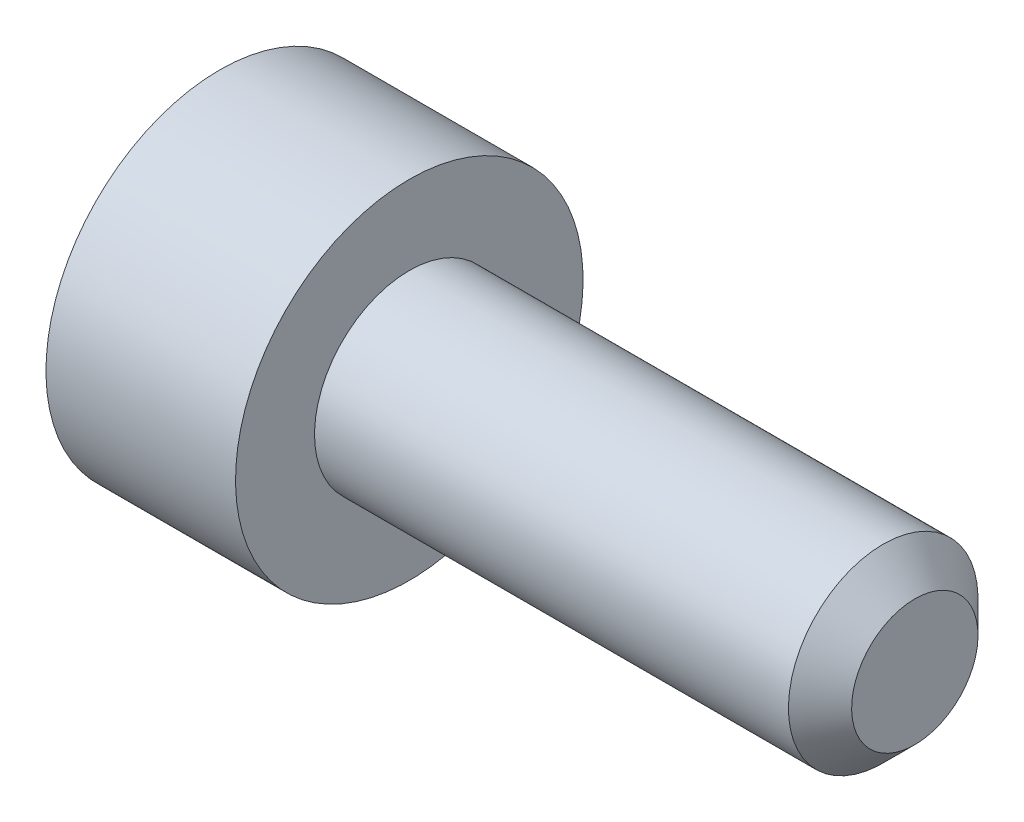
ISO-10303-21;
HEADER;
FILE_DESCRIPTION(('STEP AP214'),'2;1');
FILE_NAME('part.step','',(''),(''),'','','');
FILE_SCHEMA(('AUTOMOTIVE_DESIGN { 1 0 10303 214 1 1 1 1 }'));
ENDSEC;
DATA;
#1=APPLICATION_CONTEXT('core data for automotive mechanical design processes');
#2=APPLICATION_PROTOCOL_DEFINITION('international standard','automotive_design',2000,#1);
#3=PRODUCT_CONTEXT('',#1,'mechanical');
#4=PRODUCT('Part','Part','',(#3));
#5=PRODUCT_RELATED_PRODUCT_CATEGORY('part','',(#4));
#6=PRODUCT_DEFINITION_FORMATION('','',#4);
#7=PRODUCT_DEFINITION_CONTEXT('part definition',#1,'design');
#8=PRODUCT_DEFINITION('design','',#6,#7);
#9=PRODUCT_DEFINITION_SHAPE('','',#8);
#10=(LENGTH_UNIT() NAMED_UNIT(*) SI_UNIT(.MILLI.,.METRE.));
#11=(NAMED_UNIT(*) PLANE_ANGLE_UNIT() SI_UNIT($,.RADIAN.));
#12=(NAMED_UNIT(*) SI_UNIT($,.STERADIAN.) SOLID_ANGLE_UNIT());
#13=UNCERTAINTY_MEASURE_WITH_UNIT(LENGTH_MEASURE(1.E-05),#10,'distance_accuracy_value','');
#14=(GEOMETRIC_REPRESENTATION_CONTEXT(3) GLOBAL_UNCERTAINTY_ASSIGNED_CONTEXT((#13)) GLOBAL_UNIT_ASSIGNED_CONTEXT((#10,
#11,#12)) REPRESENTATION_CONTEXT('',''));
#15=CARTESIAN_POINT('',(0.,0.,0.));
#16=DIRECTION('',(0.,0.,1.));
#17=DIRECTION('',(1.,0.,0.));
#18=AXIS2_PLACEMENT_3D('',#15,#16,#17);
#19=CARTESIAN_POINT('',(-5.,6.875,0.));
#20=DIRECTION('',(-1.,0.,0.));
#21=DIRECTION('',(0.,0.,1.));
#22=AXIS2_PLACEMENT_3D('',#19,#20,#21);
#23=PLANE('',#22);
#24=DIRECTION('',(0.,-0.866025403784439,-0.5));
#25=VECTOR('',#24,1.);
#26=CARTESIAN_POINT('',(-5.,5.078125,1.19980602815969));
#27=LINE('',#26,#25);
#28=CARTESIAN_POINT('',(-5.,5.5,1.44337567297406));
#29=VERTEX_POINT('',#28);
#30=CARTESIAN_POINT('',(-5.,4.25,0.721687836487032));
#31=VERTEX_POINT('',#30);
#32=EDGE_CURVE('E10',#29,#31,#27,.T.);
#33=ORIENTED_EDGE('',*,*,#32,.T.);
#34=DIRECTION('',(0.,0.,-1.));
#35=VECTOR('',#34,1.);
#36=CARTESIAN_POINT('',(-5.,4.25,-0.360843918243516));
#37=LINE('',#36,#35);
#38=CARTESIAN_POINT('',(-5.,4.25,-0.721687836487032));
#39=VERTEX_POINT('',#38);
#40=EDGE_CURVE('E25',#31,#39,#37,.T.);
#41=ORIENTED_EDGE('',*,*,#40,.T.);
#42=DIRECTION('',(0.,0.866025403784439,-0.5));
#43=VECTOR('',#42,1.);
#44=CARTESIAN_POINT('',(-5.,5.703125,-1.56064994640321));
#45=LINE('',#44,#43);
#46=CARTESIAN_POINT('',(-5.,5.5,-1.44337567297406));
#47=VERTEX_POINT('',#46);
#48=EDGE_CURVE('E124',#39,#47,#45,.T.);
#49=ORIENTED_EDGE('',*,*,#48,.T.);
#50=DIRECTION('',(0.,0.866025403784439,0.5));
#51=VECTOR('',#50,1.);
#52=CARTESIAN_POINT('',(-5.,6.953125,-0.60441356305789));
#53=LINE('',#52,#51);
#54=CARTESIAN_POINT('',(-5.,6.75,-0.721687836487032));
#55=VERTEX_POINT('',#54);
#56=EDGE_CURVE('E115',#47,#55,#53,.T.);
#57=ORIENTED_EDGE('',*,*,#56,.T.);
#58=DIRECTION('',(0.,0.,1.));
#59=VECTOR('',#58,1.);
#60=CARTESIAN_POINT('',(-5.,6.75,0.360843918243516));
#61=LINE('',#60,#59);
#62=CARTESIAN_POINT('',(-5.,6.75,0.721687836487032));
#63=VERTEX_POINT('',#62);
#64=EDGE_CURVE('E113',#55,#63,#61,.T.);
#65=ORIENTED_EDGE('',*,*,#64,.T.);
#66=DIRECTION('',(0.,-0.866025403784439,0.5));
#67=VECTOR('',#66,1.);
#68=CARTESIAN_POINT('',(-5.,6.328125,0.965257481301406));
#69=LINE('',#68,#67);
#70=EDGE_CURVE('E116',#63,#29,#69,.T.);
#71=ORIENTED_EDGE('',*,*,#70,.T.);
#72=EDGE_LOOP('',(#33,#41,#49,#57,#65,#71));
#73=FACE_BOUND('',#72,.T.);
#74=CARTESIAN_POINT('',(-5.,5.5,0.));
#75=DIRECTION('',(-1.,0.,0.));
#76=DIRECTION('',(0.,1.,0.));
#77=AXIS2_PLACEMENT_3D('',#74,#75,#76);
#78=CIRCLE('',#77,2.75);
#79=CARTESIAN_POINT('',(-5.,8.25,0.));
#80=VERTEX_POINT('',#79);
#81=EDGE_CURVE('E118',#80,#80,#78,.T.);
#82=ORIENTED_EDGE('',*,*,#81,.T.);
#83=EDGE_LOOP('',(#82));
#84=FACE_BOUND('',#83,.T.);
#85=ADVANCED_FACE('F15',(#73,#84),#23,.T.);
#86=CARTESIAN_POINT('',(-2.,7.625,0.));
#87=DIRECTION('',(1.,0.,0.));
#88=DIRECTION('',(0.,0.,-1.));
#89=AXIS2_PLACEMENT_3D('',#86,#87,#88);
#90=PLANE('',#89);
#91=CARTESIAN_POINT('',(-2.,5.5,0.));
#92=DIRECTION('',(-1.,0.,0.));
#93=DIRECTION('',(0.,1.,0.));
#94=AXIS2_PLACEMENT_3D('',#91,#92,#93);
#95=CIRCLE('',#94,1.49999999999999);
#96=CARTESIAN_POINT('',(-2.,6.99999999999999,0.));
#97=VERTEX_POINT('',#96);
#98=EDGE_CURVE('E79',#97,#97,#95,.T.);
#99=ORIENTED_EDGE('',*,*,#98,.T.);
#100=EDGE_LOOP('',(#99));
#101=FACE_BOUND('',#100,.T.);
#102=CARTESIAN_POINT('',(-2.,5.5,0.));
#103=DIRECTION('',(-1.,0.,0.));
#104=DIRECTION('',(0.,1.,0.));
#105=AXIS2_PLACEMENT_3D('',#102,#103,#104);
#106=CIRCLE('',#105,2.75);
#107=CARTESIAN_POINT('',(-2.,8.25,0.));
#108=VERTEX_POINT('',#107);
#109=EDGE_CURVE('E112',#108,#108,#106,.T.);
#110=ORIENTED_EDGE('',*,*,#109,.F.);
#111=EDGE_LOOP('',(#110));
#112=FACE_BOUND('',#111,.T.);
#113=ADVANCED_FACE('F129',(#101,#112),#90,.T.);
#114=CARTESIAN_POINT('',(6.,6.,0.));
#115=DIRECTION('',(1.,0.,0.));
#116=DIRECTION('',(0.,0.,-1.));
#117=AXIS2_PLACEMENT_3D('',#114,#115,#116);
#118=PLANE('',#117);
#119=CARTESIAN_POINT('',(6.,5.5,0.));
#120=DIRECTION('',(-1.,0.,0.));
#121=DIRECTION('',(0.,1.,0.));
#122=AXIS2_PLACEMENT_3D('',#119,#120,#121);
#123=CIRCLE('',#122,0.999999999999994);
#124=CARTESIAN_POINT('',(6.,6.49999999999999,0.));
#125=VERTEX_POINT('',#124);
#126=EDGE_CURVE('E90',#125,#125,#123,.T.);
#127=ORIENTED_EDGE('',*,*,#126,.F.);
#128=EDGE_LOOP('',(#127));
#129=FACE_BOUND('',#128,.T.);
#130=ADVANCED_FACE('F154',(#129),#118,.T.);
#131=CARTESIAN_POINT('',(-3.,5.5,0.));
#132=DIRECTION('',(-1.,0.,0.));
#133=DIRECTION('',(0.,0.,1.));
#134=AXIS2_PLACEMENT_3D('',#131,#132,#133);
#135=PLANE('',#134);
#136=DIRECTION('',(0.,0.866025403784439,0.5));
#137=VECTOR('',#136,1.);
#138=CARTESIAN_POINT('',(-3.,4.25,0.721687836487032));
#139=LINE('',#138,#137);
#140=CARTESIAN_POINT('',(-3.,4.25,0.721687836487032));
#141=VERTEX_POINT('',#140);
#142=CARTESIAN_POINT('',(-3.,5.5,1.44337567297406));
#143=VERTEX_POINT('',#142);
#144=EDGE_CURVE('E73',#141,#143,#139,.T.);
#145=ORIENTED_EDGE('',*,*,#144,.T.);
#146=DIRECTION('',(0.,0.866025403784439,-0.5));
#147=VECTOR('',#146,1.);
#148=CARTESIAN_POINT('',(-3.,5.5,1.44337567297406));
#149=LINE('',#148,#147);
#150=CARTESIAN_POINT('',(-3.,6.75,0.721687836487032));
#151=VERTEX_POINT('',#150);
#152=EDGE_CURVE('E80',#143,#151,#149,.T.);
#153=ORIENTED_EDGE('',*,*,#152,.T.);
#154=DIRECTION('',(0.,0.,-1.));
#155=VECTOR('',#154,1.);
#156=CARTESIAN_POINT('',(-3.,6.75,0.721687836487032));
#157=LINE('',#156,#155);
#158=CARTESIAN_POINT('',(-3.,6.75,-0.721687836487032));
#159=VERTEX_POINT('',#158);
#160=EDGE_CURVE('E106',#151,#159,#157,.T.);
#161=ORIENTED_EDGE('',*,*,#160,.T.);
#162=DIRECTION('',(0.,-0.866025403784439,-0.5));
#163=VECTOR('',#162,1.);
#164=CARTESIAN_POINT('',(-3.,6.75,-0.721687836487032));
#165=LINE('',#164,#163);
#166=CARTESIAN_POINT('',(-3.,5.5,-1.44337567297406));
#167=VERTEX_POINT('',#166);
#168=EDGE_CURVE('E87',#159,#167,#165,.T.);
#169=ORIENTED_EDGE('',*,*,#168,.T.);
#170=DIRECTION('',(0.,-0.866025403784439,0.5));
#171=VECTOR('',#170,1.);
#172=CARTESIAN_POINT('',(-3.,5.5,-1.44337567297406));
#173=LINE('',#172,#171);
#174=CARTESIAN_POINT('',(-3.,4.25,-0.721687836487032));
#175=VERTEX_POINT('',#174);
#176=EDGE_CURVE('E85',#167,#175,#173,.T.);
#177=ORIENTED_EDGE('',*,*,#176,.T.);
#178=DIRECTION('',(0.,0.,1.));
#179=VECTOR('',#178,1.);
#180=CARTESIAN_POINT('',(-3.,4.25,-0.721687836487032));
#181=LINE('',#180,#179);
#182=EDGE_CURVE('E66',#175,#141,#181,.T.);
#183=ORIENTED_EDGE('',*,*,#182,.T.);
#184=EDGE_LOOP('',(#145,#153,#161,#169,#177,#183));
#185=FACE_BOUND('',#184,.T.);
#186=ADVANCED_FACE('F83',(#185),#135,.T.);
#187=CARTESIAN_POINT('',(-5.,4.25,-0.721687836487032));
#188=DIRECTION('',(0.,1.,0.));
#189=DIRECTION('',(0.,0.,1.));
#190=AXIS2_PLACEMENT_3D('',#187,#188,#189);
#191=PLANE('',#190);
#192=ORIENTED_EDGE('',*,*,#182,.F.);
#193=DIRECTION('',(1.,0.,0.));
#194=VECTOR('',#193,1.);
#195=CARTESIAN_POINT('',(-5.,4.25,-0.721687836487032));
#196=LINE('',#195,#194);
#197=EDGE_CURVE('E69',#39,#175,#196,.T.);
#198=ORIENTED_EDGE('',*,*,#197,.F.);
#199=ORIENTED_EDGE('',*,*,#40,.F.);
#200=DIRECTION('',(1.,0.,0.));
#201=VECTOR('',#200,1.);
#202=CARTESIAN_POINT('',(-5.,4.25,0.721687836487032));
#203=LINE('',#202,#201);
#204=EDGE_CURVE('E62',#31,#141,#203,.T.);
#205=ORIENTED_EDGE('',*,*,#204,.T.);
#206=EDGE_LOOP('',(#192,#198,#199,#205));
#207=FACE_BOUND('',#206,.T.);
#208=ADVANCED_FACE('F64',(#207),#191,.T.);
#209=CARTESIAN_POINT('',(-5.,5.5,-1.44337567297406));
#210=DIRECTION('',(0.,0.5,0.866025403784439));
#211=DIRECTION('',(0.,-0.866025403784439,0.5));
#212=AXIS2_PLACEMENT_3D('',#209,#210,#211);
#213=PLANE('',#212);
#214=ORIENTED_EDGE('',*,*,#176,.F.);
#215=DIRECTION('',(1.,0.,0.));
#216=VECTOR('',#215,1.);
#217=CARTESIAN_POINT('',(-5.,5.5,-1.44337567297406));
#218=LINE('',#217,#216);
#219=EDGE_CURVE('E92',#47,#167,#218,.T.);
#220=ORIENTED_EDGE('',*,*,#219,.F.);
#221=ORIENTED_EDGE('',*,*,#48,.F.);
#222=ORIENTED_EDGE('',*,*,#197,.T.);
#223=EDGE_LOOP('',(#214,#220,#221,#222));
#224=FACE_BOUND('',#223,.T.);
#225=ADVANCED_FACE('F165',(#224),#213,.T.);
#226=CARTESIAN_POINT('',(-5.,6.75,-0.721687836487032));
#227=DIRECTION('',(0.,-0.5,0.866025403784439));
#228=DIRECTION('',(0.,-0.866025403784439,-0.5));
#229=AXIS2_PLACEMENT_3D('',#226,#227,#228);
#230=PLANE('',#229);
#231=ORIENTED_EDGE('',*,*,#168,.F.);
#232=DIRECTION('',(1.,0.,0.));
#233=VECTOR('',#232,1.);
#234=CARTESIAN_POINT('',(-5.,6.75,-0.721687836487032));
#235=LINE('',#234,#233);
#236=EDGE_CURVE('E94',#55,#159,#235,.T.);
#237=ORIENTED_EDGE('',*,*,#236,.F.);
#238=ORIENTED_EDGE('',*,*,#56,.F.);
#239=ORIENTED_EDGE('',*,*,#219,.T.);
#240=EDGE_LOOP('',(#231,#237,#238,#239));
#241=FACE_BOUND('',#240,.T.);
#242=ADVANCED_FACE('F168',(#241),#230,.T.);
#243=CARTESIAN_POINT('',(-5.,6.75,0.721687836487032));
#244=DIRECTION('',(0.,-1.,0.));
#245=DIRECTION('',(0.,0.,-1.));
#246=AXIS2_PLACEMENT_3D('',#243,#244,#245);
#247=PLANE('',#246);
#248=ORIENTED_EDGE('',*,*,#160,.F.);
#249=DIRECTION('',(1.,0.,0.));
#250=VECTOR('',#249,1.);
#251=CARTESIAN_POINT('',(-5.,6.75,0.721687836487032));
#252=LINE('',#251,#250);
#253=EDGE_CURVE('E99',#63,#151,#252,.T.);
#254=ORIENTED_EDGE('',*,*,#253,.F.);
#255=ORIENTED_EDGE('',*,*,#64,.F.);
#256=ORIENTED_EDGE('',*,*,#236,.T.);
#257=EDGE_LOOP('',(#248,#254,#255,#256));
#258=FACE_BOUND('',#257,.T.);
#259=ADVANCED_FACE('F172',(#258),#247,.T.);
#260=CARTESIAN_POINT('',(-5.,5.5,1.44337567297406));
#261=DIRECTION('',(0.,-0.5,-0.866025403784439));
#262=DIRECTION('',(0.,0.866025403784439,-0.5));
#263=AXIS2_PLACEMENT_3D('',#260,#261,#262);
#264=PLANE('',#263);
#265=ORIENTED_EDGE('',*,*,#152,.F.);
#266=DIRECTION('',(1.,0.,0.));
#267=VECTOR('',#266,1.);
#268=CARTESIAN_POINT('',(-5.,5.5,1.44337567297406));
#269=LINE('',#268,#267);
#270=EDGE_CURVE('E75',#29,#143,#269,.T.);
#271=ORIENTED_EDGE('',*,*,#270,.F.);
#272=ORIENTED_EDGE('',*,*,#70,.F.);
#273=ORIENTED_EDGE('',*,*,#253,.T.);
#274=EDGE_LOOP('',(#265,#271,#272,#273));
#275=FACE_BOUND('',#274,.T.);
#276=ADVANCED_FACE('F145',(#275),#264,.T.);
#277=CARTESIAN_POINT('',(-5.,4.25,0.721687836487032));
#278=DIRECTION('',(0.,0.5,-0.866025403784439));
#279=DIRECTION('',(0.,0.866025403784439,0.5));
#280=AXIS2_PLACEMENT_3D('',#277,#278,#279);
#281=PLANE('',#280);
#282=ORIENTED_EDGE('',*,*,#144,.F.);
#283=ORIENTED_EDGE('',*,*,#204,.F.);
#284=ORIENTED_EDGE('',*,*,#32,.F.);
#285=ORIENTED_EDGE('',*,*,#270,.T.);
#286=EDGE_LOOP('',(#282,#283,#284,#285));
#287=FACE_BOUND('',#286,.T.);
#288=ADVANCED_FACE('F74',(#287),#281,.T.);
#289=DIRECTION('',(0.707106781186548,-0.707106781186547,0.));
#290=VECTOR('',#289,1.);
#291=CARTESIAN_POINT('',(-498987.5,499000.,-1.2221436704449E-10));
#292=LINE('',#291,#290);
#293=CARTESIAN_POINT('',(6.99999999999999,5.5,0.));
#294=DIRECTION('',(-1.,0.,0.));
#295=AXIS1_PLACEMENT('',#293,#294);
#296=SURFACE_OF_REVOLUTION('',#292,#295);
#297=ORIENTED_EDGE('',*,*,#126,.T.);
#298=EDGE_LOOP('',(#297));
#299=FACE_BOUND('',#298,.T.);
#300=CARTESIAN_POINT('',(5.5,5.5,0.));
#301=DIRECTION('',(-1.,0.,0.));
#302=DIRECTION('',(0.,1.,0.));
#303=AXIS2_PLACEMENT_3D('',#300,#301,#302);
#304=CIRCLE('',#303,1.49999999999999);
#305=CARTESIAN_POINT('',(5.5,6.99999999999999,0.));
#306=VERTEX_POINT('',#305);
#307=EDGE_CURVE('E121',#306,#306,#304,.T.);
#308=ORIENTED_EDGE('',*,*,#307,.F.);
#309=EDGE_LOOP('',(#308));
#310=FACE_BOUND('',#309,.T.);
#311=ADVANCED_FACE('F135',(#299,#310),#296,.F.);
#312=CARTESIAN_POINT('',(1.75,5.5,0.));
#313=DIRECTION('',(-1.,0.,0.));
#314=DIRECTION('',(0.,0.,1.));
#315=AXIS2_PLACEMENT_3D('',#312,#313,#314);
#316=CYLINDRICAL_SURFACE('',#315,1.49999999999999);
#317=ORIENTED_EDGE('',*,*,#98,.F.);
#318=EDGE_LOOP('',(#317));
#319=FACE_BOUND('',#318,.T.);
#320=ORIENTED_EDGE('',*,*,#307,.T.);
#321=EDGE_LOOP('',(#320));
#322=FACE_BOUND('',#321,.T.);
#323=ADVANCED_FACE('F132',(#319,#322),#316,.T.);
#324=CARTESIAN_POINT('',(-3.5,5.5,0.));
#325=DIRECTION('',(-1.,0.,0.));
#326=DIRECTION('',(0.,0.,1.));
#327=AXIS2_PLACEMENT_3D('',#324,#325,#326);
#328=CYLINDRICAL_SURFACE('',#327,2.75);
#329=ORIENTED_EDGE('',*,*,#81,.F.);
#330=EDGE_LOOP('',(#329));
#331=FACE_BOUND('',#330,.T.);
#332=ORIENTED_EDGE('',*,*,#109,.T.);
#333=EDGE_LOOP('',(#332));
#334=FACE_BOUND('',#333,.T.);
#335=ADVANCED_FACE('F17',(#331,#334),#328,.T.);
#336=CLOSED_SHELL('',(#85,#113,#130,#186,#208,#225,#242,#259,#276,#288,#311,#323,#335));
#337=MANIFOLD_SOLID_BREP('B1',#336);
#338=ADVANCED_BREP_SHAPE_REPRESENTATION('',(#18,#337),#14);
#339=SHAPE_DEFINITION_REPRESENTATION(#9,#338);
ENDSEC;
END-ISO-10303-21;
